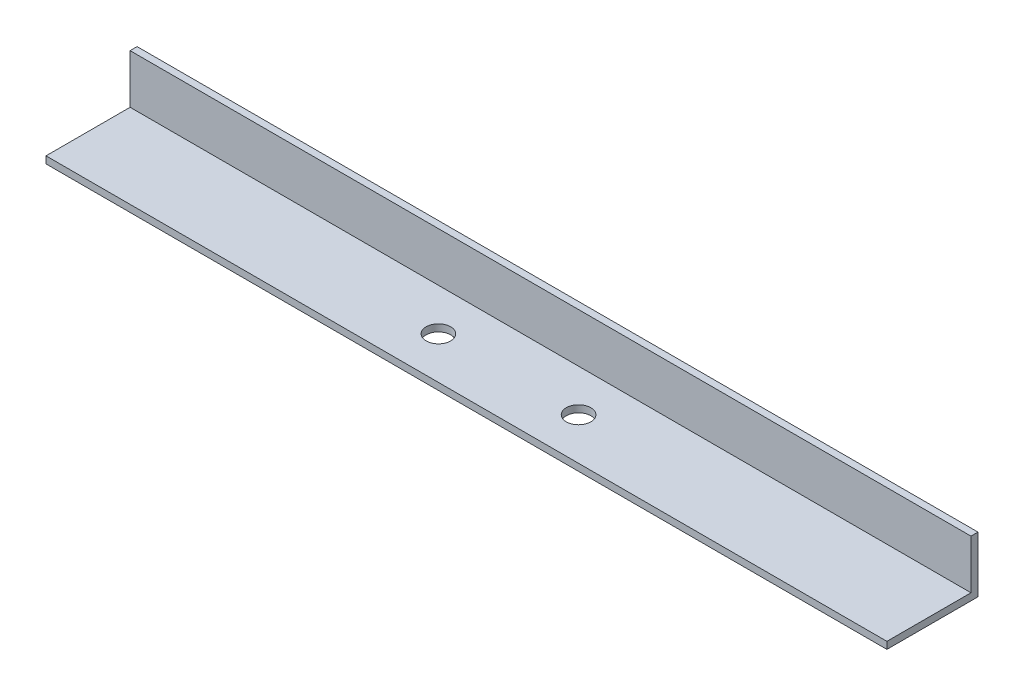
from build123d import *

# Parameters (mm, degrees)
SKETCH1_W           = 120
SKETCH1_H           = 8
BOSS_EXTRUDE1_DEPTH = 13
SKETCH2_W           = 12
SKETCH2_H           = 7
CUT_EXTRUDE1_DEPTH  = 121.966937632
SKETCH3_R           = 1.75
CUT_EXTRUDE2_DEPTH  = 10


with BuildPart() as part:
    # Sketch1 → Boss-Extrude1 (new body)
    with BuildSketch(Plane.XY):
        with Locations((60, 4)):
            Rectangle(SKETCH1_W, SKETCH1_H)
    extrude(amount=BOSS_EXTRUDE1_DEPTH)

    # Sketch2 → Cut-Extrude1 (cut, through all)
    with BuildSketch(Plane.ZY):
        with Locations((7, 4.5)):
            Rectangle(SKETCH2_W, SKETCH2_H)
    extrude(amount=-CUT_EXTRUDE1_DEPTH, mode=Mode.SUBTRACT)

    # Sketch3 → Cut-Extrude2 (cut)
    with BuildSketch(Plane.XZ):
        with Locations(Location((50, 7, 0), (0, 0, 270))):
            Circle(SKETCH3_R)
        with Locations(Location((70, 7, 0), (0, 0, 270))):
            Circle(SKETCH3_R)
    extrude(amount=-CUT_EXTRUDE2_DEPTH, mode=Mode.SUBTRACT)


solid = part.part
